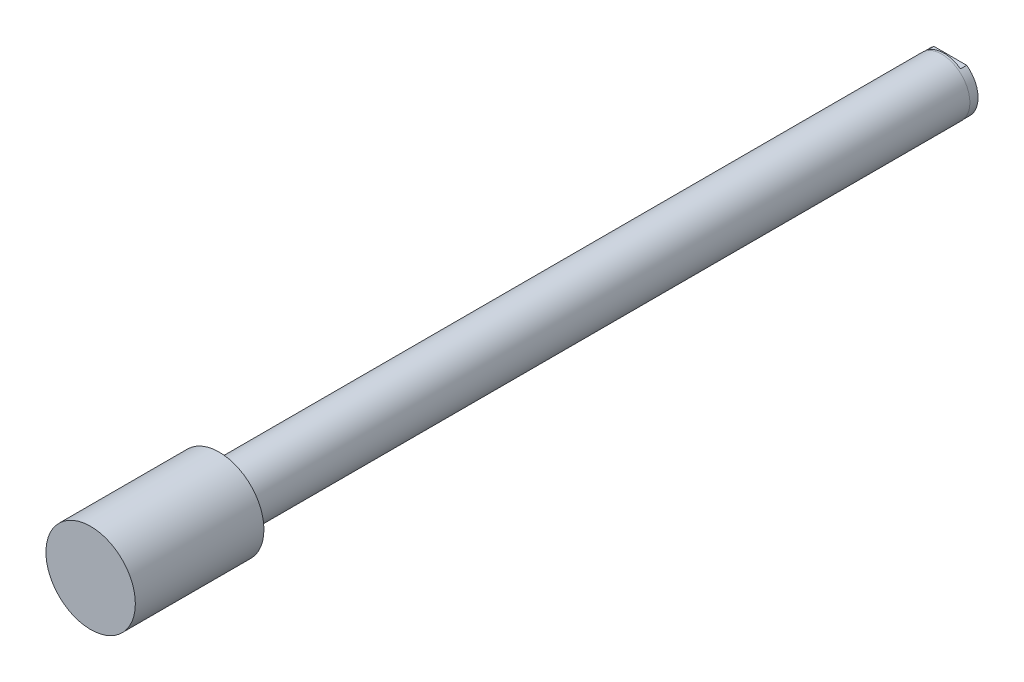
ISO-10303-21;
HEADER;
FILE_DESCRIPTION(('STEP AP214'),'2;1');
FILE_NAME('part.step','',(''),(''),'','','');
FILE_SCHEMA(('AUTOMOTIVE_DESIGN { 1 0 10303 214 1 1 1 1 }'));
ENDSEC;
DATA;
#1=APPLICATION_CONTEXT('core data for automotive mechanical design processes');
#2=APPLICATION_PROTOCOL_DEFINITION('international standard','automotive_design',2000,#1);
#3=PRODUCT_CONTEXT('',#1,'mechanical');
#4=PRODUCT('Part','Part','',(#3));
#5=PRODUCT_RELATED_PRODUCT_CATEGORY('part','',(#4));
#6=PRODUCT_DEFINITION_FORMATION('','',#4);
#7=PRODUCT_DEFINITION_CONTEXT('part definition',#1,'design');
#8=PRODUCT_DEFINITION('design','',#6,#7);
#9=PRODUCT_DEFINITION_SHAPE('','',#8);
#10=(LENGTH_UNIT() NAMED_UNIT(*) SI_UNIT(.MILLI.,.METRE.));
#11=(NAMED_UNIT(*) PLANE_ANGLE_UNIT() SI_UNIT($,.RADIAN.));
#12=(NAMED_UNIT(*) SI_UNIT($,.STERADIAN.) SOLID_ANGLE_UNIT());
#13=UNCERTAINTY_MEASURE_WITH_UNIT(LENGTH_MEASURE(1.E-05),#10,'distance_accuracy_value','');
#14=(GEOMETRIC_REPRESENTATION_CONTEXT(3) GLOBAL_UNCERTAINTY_ASSIGNED_CONTEXT((#13)) GLOBAL_UNIT_ASSIGNED_CONTEXT((#10,
#11,#12)) REPRESENTATION_CONTEXT('',''));
#15=CARTESIAN_POINT('',(0.,0.,0.));
#16=DIRECTION('',(0.,0.,1.));
#17=DIRECTION('',(1.,0.,0.));
#18=AXIS2_PLACEMENT_3D('',#15,#16,#17);
#19=CARTESIAN_POINT('',(0.,0.,39.5986));
#20=DIRECTION('',(0.,0.,-1.));
#21=DIRECTION('',(-1.,0.,0.));
#22=AXIS2_PLACEMENT_3D('',#19,#20,#21);
#23=CYLINDRICAL_SURFACE('',#22,7.25);
#24=CARTESIAN_POINT('',(0.,0.,33.528));
#25=DIRECTION('',(0.,0.,-1.));
#26=DIRECTION('',(0.,1.,0.));
#27=AXIS2_PLACEMENT_3D('',#24,#25,#26);
#28=CIRCLE('',#27,7.25);
#29=CARTESIAN_POINT('',(0.,7.25,33.528));
#30=VERTEX_POINT('',#29);
#31=EDGE_CURVE('E25',#30,#30,#28,.T.);
#32=ORIENTED_EDGE('',*,*,#31,.F.);
#33=EDGE_LOOP('',(#32));
#34=FACE_BOUND('',#33,.T.);
#35=CARTESIAN_POINT('',(0.,0.,0.));
#36=DIRECTION('',(0.,0.,-1.));
#37=DIRECTION('',(1.,0.,0.));
#38=AXIS2_PLACEMENT_3D('',#35,#36,#37);
#39=CIRCLE('',#38,7.25);
#40=CARTESIAN_POINT('',(7.25,0.,0.));
#41=VERTEX_POINT('',#40);
#42=EDGE_CURVE('E77',#41,#41,#39,.T.);
#43=ORIENTED_EDGE('',*,*,#42,.T.);
#44=EDGE_LOOP('',(#43));
#45=FACE_BOUND('',#44,.T.);
#46=ADVANCED_FACE('F16',(#34,#45),#23,.F.);
#47=CARTESIAN_POINT('',(0.,0.,488.27760000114));
#48=DIRECTION('',(0.,0.,1.));
#49=DIRECTION('',(1.,0.,0.));
#50=AXIS2_PLACEMENT_3D('',#47,#48,#49);
#51=PLANE('',#50);
#52=CARTESIAN_POINT('',(0.,0.,488.27760000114));
#53=DIRECTION('',(0.,0.,1.));
#54=DIRECTION('',(1.,0.,0.));
#55=AXIS2_PLACEMENT_3D('',#52,#53,#54);
#56=CIRCLE('',#55,25.4);
#57=CARTESIAN_POINT('',(25.4,0.,488.27760000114));
#58=VERTEX_POINT('',#57);
#59=EDGE_CURVE('E109',#58,#58,#56,.T.);
#60=ORIENTED_EDGE('',*,*,#59,.T.);
#61=EDGE_LOOP('',(#60));
#62=FACE_BOUND('',#61,.T.);
#63=ADVANCED_FACE('F134',(#62),#51,.T.);
#64=CARTESIAN_POINT('',(0.,0.,488.27760000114));
#65=DIRECTION('',(0.,0.,-1.));
#66=DIRECTION('',(-1.,0.,0.));
#67=AXIS2_PLACEMENT_3D('',#64,#65,#66);
#68=CYLINDRICAL_SURFACE('',#67,25.4);
#69=ORIENTED_EDGE('',*,*,#59,.F.);
#70=EDGE_LOOP('',(#69));
#71=FACE_BOUND('',#70,.T.);
#72=CARTESIAN_POINT('',(0.,0.,415.25260000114));
#73=DIRECTION('',(0.,0.,1.));
#74=DIRECTION('',(1.,0.,0.));
#75=AXIS2_PLACEMENT_3D('',#72,#73,#74);
#76=CIRCLE('',#75,25.4);
#77=CARTESIAN_POINT('',(25.4,0.,415.25260000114));
#78=VERTEX_POINT('',#77);
#79=EDGE_CURVE('E106',#78,#78,#76,.T.);
#80=ORIENTED_EDGE('',*,*,#79,.T.);
#81=EDGE_LOOP('',(#80));
#82=FACE_BOUND('',#81,.T.);
#83=ADVANCED_FACE('F123',(#71,#82),#68,.T.);
#84=CARTESIAN_POINT('',(0.,0.,415.25260000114));
#85=DIRECTION('',(0.,0.,1.));
#86=DIRECTION('',(1.,0.,0.));
#87=AXIS2_PLACEMENT_3D('',#84,#85,#86);
#88=PLANE('',#87);
#89=CARTESIAN_POINT('',(0.,0.,415.25260000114));
#90=DIRECTION('',(0.,0.,1.));
#91=DIRECTION('',(1.,0.,0.));
#92=AXIS2_PLACEMENT_3D('',#89,#90,#91);
#93=CIRCLE('',#92,15.875);
#94=CARTESIAN_POINT('',(15.875,0.,415.25260000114));
#95=VERTEX_POINT('',#94);
#96=EDGE_CURVE('E73',#95,#95,#93,.F.);
#97=ORIENTED_EDGE('',*,*,#96,.F.);
#98=EDGE_LOOP('',(#97));
#99=FACE_BOUND('',#98,.T.);
#100=ORIENTED_EDGE('',*,*,#79,.F.);
#101=EDGE_LOOP('',(#100));
#102=FACE_BOUND('',#101,.T.);
#103=ADVANCED_FACE('F120',(#99,#102),#88,.F.);
#104=CARTESIAN_POINT('',(0.,0.,415.25260000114));
#105=DIRECTION('',(0.,0.,-1.));
#106=DIRECTION('',(-1.,0.,0.));
#107=AXIS2_PLACEMENT_3D('',#104,#105,#106);
#108=CYLINDRICAL_SURFACE('',#107,15.875);
#109=CARTESIAN_POINT('',(0.,0.,4.7752));
#110=DIRECTION('',(0.,0.,-1.));
#111=DIRECTION('',(-1.,0.,0.));
#112=AXIS2_PLACEMENT_3D('',#109,#110,#111);
#113=CIRCLE('',#112,15.875);
#114=CARTESIAN_POINT('',(-15.875,0.,4.7752));
#115=VERTEX_POINT('',#114);
#116=EDGE_CURVE('E70',#115,#115,#113,.T.);
#117=ORIENTED_EDGE('',*,*,#116,.F.);
#118=EDGE_LOOP('',(#117));
#119=FACE_BOUND('',#118,.T.);
#120=ORIENTED_EDGE('',*,*,#96,.T.);
#121=EDGE_LOOP('',(#120));
#122=FACE_BOUND('',#121,.T.);
#123=ADVANCED_FACE('F118',(#119,#122),#108,.T.);
#124=CARTESIAN_POINT('',(0.,0.,4.7752));
#125=DIRECTION('',(0.,0.,-1.));
#126=DIRECTION('',(-1.,0.,0.));
#127=AXIS2_PLACEMENT_3D('',#124,#125,#126);
#128=PLANE('',#127);
#129=CARTESIAN_POINT('',(0.,0.,4.7752));
#130=DIRECTION('',(0.,0.,-1.));
#131=DIRECTION('',(0.,1.,0.));
#132=AXIS2_PLACEMENT_3D('',#129,#130,#131);
#133=CIRCLE('',#132,15.7607);
#134=CARTESIAN_POINT('',(0.,15.7607,4.7752));
#135=VERTEX_POINT('',#134);
#136=EDGE_CURVE('E10',#135,#135,#133,.T.);
#137=ORIENTED_EDGE('',*,*,#136,.F.);
#138=EDGE_LOOP('',(#137));
#139=FACE_BOUND('',#138,.T.);
#140=ORIENTED_EDGE('',*,*,#116,.T.);
#141=EDGE_LOOP('',(#140));
#142=FACE_BOUND('',#141,.T.);
#143=ADVANCED_FACE('F131',(#139,#142),#128,.T.);
#144=CARTESIAN_POINT('',(0.,0.,3.556));
#145=DIRECTION('',(0.,0.,-1.));
#146=DIRECTION('',(1.,0.,0.));
#147=AXIS2_PLACEMENT_3D('',#144,#145,#146);
#148=PLANE('',#147);
#149=CARTESIAN_POINT('',(0.,0.,3.556));
#150=DIRECTION('',(0.,0.,-1.));
#151=DIRECTION('',(1.,0.,0.));
#152=AXIS2_PLACEMENT_3D('',#149,#150,#151);
#153=CIRCLE('',#152,15.7607);
#154=CARTESIAN_POINT('',(-9.33325583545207,12.7,3.556));
#155=VERTEX_POINT('',#154);
#156=CARTESIAN_POINT('',(9.33325583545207,12.7,3.556));
#157=VERTEX_POINT('',#156);
#158=EDGE_CURVE('E81',#155,#157,#153,.T.);
#159=ORIENTED_EDGE('',*,*,#158,.T.);
#160=DIRECTION('',(-1.,0.,0.));
#161=VECTOR('',#160,1.);
#162=CARTESIAN_POINT('',(-9.33325583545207,12.7,3.556));
#163=LINE('',#162,#161);
#164=EDGE_CURVE('E83',#157,#155,#163,.T.);
#165=ORIENTED_EDGE('',*,*,#164,.T.);
#166=EDGE_LOOP('',(#159,#165));
#167=FACE_BOUND('',#166,.T.);
#168=ADVANCED_FACE('F141',(#167),#148,.T.);
#169=CARTESIAN_POINT('',(0.,0.,3.556));
#170=DIRECTION('',(0.,0.,-1.));
#171=DIRECTION('',(1.,0.,0.));
#172=AXIS2_PLACEMENT_3D('',#169,#170,#171);
#173=PLANE('',#172);
#174=CARTESIAN_POINT('',(0.,0.,3.556));
#175=DIRECTION('',(0.,0.,-1.));
#176=DIRECTION('',(1.,0.,0.));
#177=AXIS2_PLACEMENT_3D('',#174,#175,#176);
#178=CIRCLE('',#177,15.7607);
#179=CARTESIAN_POINT('',(9.33325583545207,-12.7,3.556));
#180=VERTEX_POINT('',#179);
#181=CARTESIAN_POINT('',(-9.33325583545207,-12.7,3.556));
#182=VERTEX_POINT('',#181);
#183=EDGE_CURVE('E92',#180,#182,#178,.T.);
#184=ORIENTED_EDGE('',*,*,#183,.T.);
#185=DIRECTION('',(1.,0.,0.));
#186=VECTOR('',#185,1.);
#187=CARTESIAN_POINT('',(-9.33325583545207,-12.7,3.556));
#188=LINE('',#187,#186);
#189=EDGE_CURVE('E94',#182,#180,#188,.T.);
#190=ORIENTED_EDGE('',*,*,#189,.T.);
#191=EDGE_LOOP('',(#184,#190));
#192=FACE_BOUND('',#191,.T.);
#193=ADVANCED_FACE('F146',(#192),#173,.T.);
#194=CARTESIAN_POINT('',(-9.33325583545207,-12.7,3.556));
#195=DIRECTION('',(0.,1.,0.));
#196=DIRECTION('',(0.,0.,1.));
#197=AXIS2_PLACEMENT_3D('',#194,#195,#196);
#198=PLANE('',#197);
#199=DIRECTION('',(1.,0.,0.));
#200=VECTOR('',#199,1.);
#201=CARTESIAN_POINT('',(-9.33325583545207,-12.7,0.));
#202=LINE('',#201,#200);
#203=CARTESIAN_POINT('',(-9.33325583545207,-12.7,0.));
#204=VERTEX_POINT('',#203);
#205=CARTESIAN_POINT('',(9.33325583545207,-12.7,0.));
#206=VERTEX_POINT('',#205);
#207=EDGE_CURVE('E90',#204,#206,#202,.T.);
#208=ORIENTED_EDGE('',*,*,#207,.T.);
#209=DIRECTION('',(0.,0.,-1.));
#210=VECTOR('',#209,1.);
#211=CARTESIAN_POINT('',(9.33325583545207,-12.7,3.556));
#212=LINE('',#211,#210);
#213=EDGE_CURVE('E98',#180,#206,#212,.T.);
#214=ORIENTED_EDGE('',*,*,#213,.F.);
#215=ORIENTED_EDGE('',*,*,#189,.F.);
#216=DIRECTION('',(0.,0.,-1.));
#217=VECTOR('',#216,1.);
#218=CARTESIAN_POINT('',(-9.33325583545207,-12.7,3.556));
#219=LINE('',#218,#217);
#220=EDGE_CURVE('E41',#182,#204,#219,.T.);
#221=ORIENTED_EDGE('',*,*,#220,.T.);
#222=EDGE_LOOP('',(#208,#214,#215,#221));
#223=FACE_BOUND('',#222,.T.);
#224=ADVANCED_FACE('F154',(#223),#198,.F.);
#225=CARTESIAN_POINT('',(0.,0.,0.));
#226=DIRECTION('',(0.,0.,-1.));
#227=DIRECTION('',(1.,0.,0.));
#228=AXIS2_PLACEMENT_3D('',#225,#226,#227);
#229=PLANE('',#228);
#230=ORIENTED_EDGE('',*,*,#42,.F.);
#231=EDGE_LOOP('',(#230));
#232=FACE_BOUND('',#231,.T.);
#233=DIRECTION('',(-1.,0.,0.));
#234=VECTOR('',#233,1.);
#235=CARTESIAN_POINT('',(-9.33325583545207,12.7,0.));
#236=LINE('',#235,#234);
#237=CARTESIAN_POINT('',(9.33325583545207,12.7,0.));
#238=VERTEX_POINT('',#237);
#239=CARTESIAN_POINT('',(-9.33325583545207,12.7,0.));
#240=VERTEX_POINT('',#239);
#241=EDGE_CURVE('E80',#238,#240,#236,.T.);
#242=ORIENTED_EDGE('',*,*,#241,.F.);
#243=CARTESIAN_POINT('',(0.,0.,0.));
#244=DIRECTION('',(0.,0.,-1.));
#245=DIRECTION('',(1.,0.,0.));
#246=AXIS2_PLACEMENT_3D('',#243,#244,#245);
#247=CIRCLE('',#246,15.7607);
#248=EDGE_CURVE('E100',#238,#206,#247,.T.);
#249=ORIENTED_EDGE('',*,*,#248,.T.);
#250=ORIENTED_EDGE('',*,*,#207,.F.);
#251=EDGE_CURVE('E20',#204,#240,#247,.T.);
#252=ORIENTED_EDGE('',*,*,#251,.T.);
#253=EDGE_LOOP('',(#242,#249,#250,#252));
#254=FACE_BOUND('',#253,.T.);
#255=ADVANCED_FACE('F151',(#232,#254),#229,.T.);
#256=CARTESIAN_POINT('',(-9.33325583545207,12.7,3.556));
#257=DIRECTION('',(0.,-1.,0.));
#258=DIRECTION('',(0.,0.,-1.));
#259=AXIS2_PLACEMENT_3D('',#256,#257,#258);
#260=PLANE('',#259);
#261=ORIENTED_EDGE('',*,*,#241,.T.);
#262=DIRECTION('',(0.,0.,-1.));
#263=VECTOR('',#262,1.);
#264=CARTESIAN_POINT('',(-9.33325583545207,12.7,3.556));
#265=LINE('',#264,#263);
#266=EDGE_CURVE('E87',#155,#240,#265,.T.);
#267=ORIENTED_EDGE('',*,*,#266,.F.);
#268=ORIENTED_EDGE('',*,*,#164,.F.);
#269=DIRECTION('',(0.,0.,-1.));
#270=VECTOR('',#269,1.);
#271=CARTESIAN_POINT('',(9.33325583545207,12.7,3.556));
#272=LINE('',#271,#270);
#273=EDGE_CURVE('E33',#157,#238,#272,.T.);
#274=ORIENTED_EDGE('',*,*,#273,.T.);
#275=EDGE_LOOP('',(#261,#267,#268,#274));
#276=FACE_BOUND('',#275,.T.);
#277=ADVANCED_FACE('F148',(#276),#260,.F.);
#278=CARTESIAN_POINT('',(0.,0.,4.7752));
#279=DIRECTION('',(0.,0.,-1.));
#280=DIRECTION('',(1.,0.,0.));
#281=AXIS2_PLACEMENT_3D('',#278,#279,#280);
#282=CYLINDRICAL_SURFACE('',#281,15.7607);
#283=ORIENTED_EDGE('',*,*,#266,.T.);
#284=ORIENTED_EDGE('',*,*,#251,.F.);
#285=ORIENTED_EDGE('',*,*,#220,.F.);
#286=ORIENTED_EDGE('',*,*,#183,.F.);
#287=ORIENTED_EDGE('',*,*,#213,.T.);
#288=ORIENTED_EDGE('',*,*,#248,.F.);
#289=ORIENTED_EDGE('',*,*,#273,.F.);
#290=ORIENTED_EDGE('',*,*,#158,.F.);
#291=EDGE_LOOP('',(#283,#284,#285,#286,#287,#288,#289,#290));
#292=FACE_BOUND('',#291,.T.);
#293=ORIENTED_EDGE('',*,*,#136,.T.);
#294=EDGE_LOOP('',(#293));
#295=FACE_BOUND('',#294,.T.);
#296=ADVANCED_FACE('F18',(#292,#295),#282,.T.);
#297=CARTESIAN_POINT('',(0.,0.,33.528));
#298=DIRECTION('',(0.,0.,-1.));
#299=DIRECTION('',(1.,0.,0.));
#300=AXIS2_PLACEMENT_3D('',#297,#298,#299);
#301=CONICAL_SURFACE('',#300,7.25,1.02974425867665);
#302=CARTESIAN_POINT('',(0.,0.,37.8842394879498));
#303=VERTEX_POINT('',#302);
#304=VERTEX_LOOP('',#303);
#305=FACE_BOUND('',#304,.T.);
#306=ORIENTED_EDGE('',*,*,#31,.T.);
#307=EDGE_LOOP('',(#306));
#308=FACE_BOUND('',#307,.T.);
#309=ADVANCED_FACE('F63',(#305,#308),#301,.F.);
#310=CLOSED_SHELL('',(#46,#63,#83,#103,#123,#143,#168,#193,#224,#255,#277,#296,#309));
#311=MANIFOLD_SOLID_BREP('B1',#310);
#312=ADVANCED_BREP_SHAPE_REPRESENTATION('',(#18,#311),#14);
#313=SHAPE_DEFINITION_REPRESENTATION(#9,#312);
ENDSEC;
END-ISO-10303-21;
